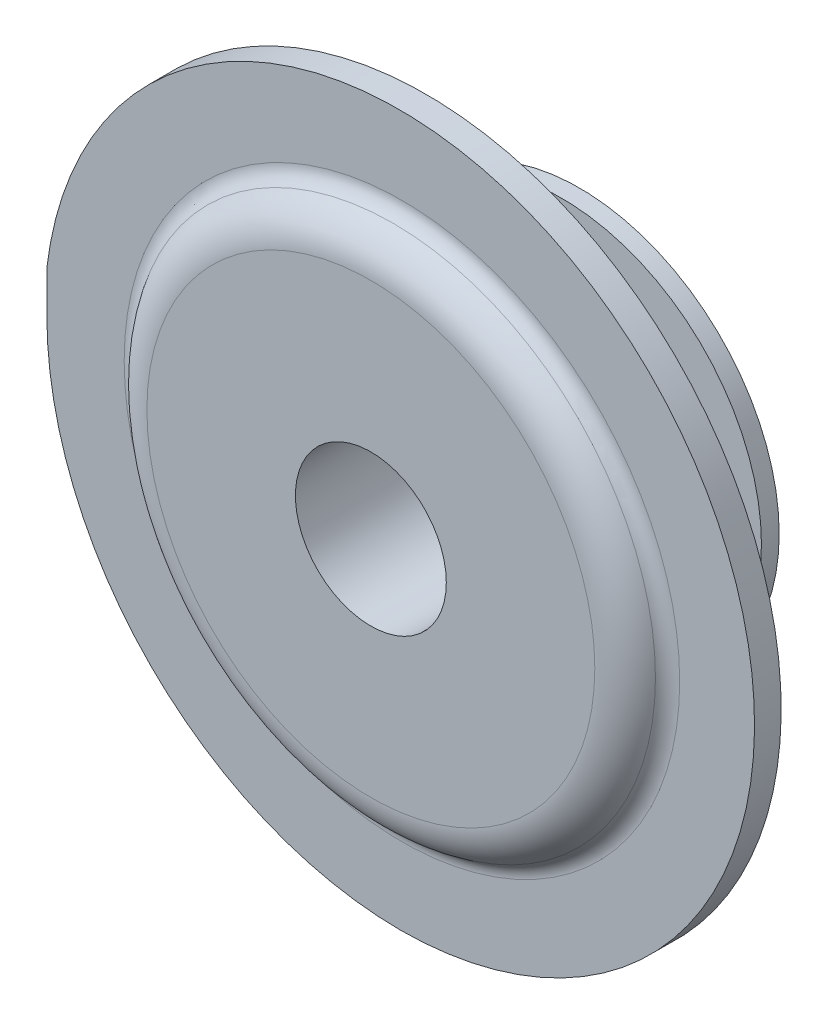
ISO-10303-21;
HEADER;
FILE_DESCRIPTION(('STEP AP214'),'2;1');
FILE_NAME('part.step','',(''),(''),'','','');
FILE_SCHEMA(('AUTOMOTIVE_DESIGN { 1 0 10303 214 1 1 1 1 }'));
ENDSEC;
DATA;
#1=APPLICATION_CONTEXT('core data for automotive mechanical design processes');
#2=APPLICATION_PROTOCOL_DEFINITION('international standard','automotive_design',2000,#1);
#3=PRODUCT_CONTEXT('',#1,'mechanical');
#4=PRODUCT('Part','Part','',(#3));
#5=PRODUCT_RELATED_PRODUCT_CATEGORY('part','',(#4));
#6=PRODUCT_DEFINITION_FORMATION('','',#4);
#7=PRODUCT_DEFINITION_CONTEXT('part definition',#1,'design');
#8=PRODUCT_DEFINITION('design','',#6,#7);
#9=PRODUCT_DEFINITION_SHAPE('','',#8);
#10=(LENGTH_UNIT() NAMED_UNIT(*) SI_UNIT(.MILLI.,.METRE.));
#11=(NAMED_UNIT(*) PLANE_ANGLE_UNIT() SI_UNIT($,.RADIAN.));
#12=(NAMED_UNIT(*) SI_UNIT($,.STERADIAN.) SOLID_ANGLE_UNIT());
#13=UNCERTAINTY_MEASURE_WITH_UNIT(LENGTH_MEASURE(1.E-05),#10,'distance_accuracy_value','');
#14=(GEOMETRIC_REPRESENTATION_CONTEXT(3) GLOBAL_UNCERTAINTY_ASSIGNED_CONTEXT((#13)) GLOBAL_UNIT_ASSIGNED_CONTEXT((#10,
#11,#12)) REPRESENTATION_CONTEXT('',''));
#15=CARTESIAN_POINT('',(0.,0.,0.));
#16=DIRECTION('',(0.,0.,1.));
#17=DIRECTION('',(1.,0.,0.));
#18=AXIS2_PLACEMENT_3D('',#15,#16,#17);
#19=CARTESIAN_POINT('',(0.,0.,0.15));
#20=DIRECTION('',(0.,0.,1.));
#21=DIRECTION('',(1.,0.,0.));
#22=AXIS2_PLACEMENT_3D('',#19,#20,#21);
#23=PLANE('',#22);
#24=CARTESIAN_POINT('',(0.,-12.,0.15));
#25=DIRECTION('',(0.,0.,1.));
#26=DIRECTION('',(1.,0.,0.));
#27=AXIS2_PLACEMENT_3D('',#24,#25,#26);
#28=CIRCLE('',#27,3.12924818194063);
#29=CARTESIAN_POINT('',(3.12924818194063,-12.,0.15));
#30=VERTEX_POINT('',#29);
#31=EDGE_CURVE('E92',#30,#30,#28,.F.);
#32=ORIENTED_EDGE('',*,*,#31,.T.);
#33=EDGE_LOOP('',(#32));
#34=FACE_BOUND('',#33,.T.);
#35=CARTESIAN_POINT('',(0.,-12.,0.15));
#36=DIRECTION('',(0.,0.,1.));
#37=DIRECTION('',(1.,0.,0.));
#38=AXIS2_PLACEMENT_3D('',#35,#36,#37);
#39=CIRCLE('',#38,4.);
#40=CARTESIAN_POINT('',(-4.,-12.,0.15));
#41=VERTEX_POINT('',#40);
#42=CARTESIAN_POINT('',(-0.0138167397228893,-15.9999761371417,0.15));
#43=VERTEX_POINT('',#42);
#44=EDGE_CURVE('E81',#41,#43,#39,.T.);
#45=ORIENTED_EDGE('',*,*,#44,.T.);
#46=CARTESIAN_POINT('',(-0.0276334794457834,-12.,0.150000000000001));
#47=DIRECTION('',(0.,0.,1.));
#48=DIRECTION('',(1.,0.,0.));
#49=AXIS2_PLACEMENT_3D('',#46,#47,#48);
#50=CIRCLE('',#49,4.);
#51=CARTESIAN_POINT('',(-4.,-11.530634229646,0.150000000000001));
#52=VERTEX_POINT('',#51);
#53=EDGE_CURVE('E45',#43,#52,#50,.T.);
#54=ORIENTED_EDGE('',*,*,#53,.T.);
#55=DIRECTION('',(0.,-1.,0.));
#56=VECTOR('',#55,1.);
#57=CARTESIAN_POINT('',(-4.,0.,0.15));
#58=LINE('',#57,#56);
#59=EDGE_CURVE('E52',#52,#41,#58,.T.);
#60=ORIENTED_EDGE('',*,*,#59,.T.);
#61=EDGE_LOOP('',(#45,#54,#60));
#62=FACE_BOUND('',#61,.T.);
#63=ADVANCED_FACE('F31',(#34,#62),#23,.T.);
#64=CARTESIAN_POINT('',(0.,0.,-0.15));
#65=DIRECTION('',(0.,0.,1.));
#66=DIRECTION('',(1.,0.,0.));
#67=AXIS2_PLACEMENT_3D('',#64,#65,#66);
#68=PLANE('',#67);
#69=CARTESIAN_POINT('',(0.,-12.,-0.15));
#70=DIRECTION('',(0.,0.,1.));
#71=DIRECTION('',(1.,0.,0.));
#72=AXIS2_PLACEMENT_3D('',#69,#70,#71);
#73=CIRCLE('',#72,1.);
#74=CARTESIAN_POINT('',(1.,-12.,-0.15));
#75=VERTEX_POINT('',#74);
#76=EDGE_CURVE('E83',#75,#75,#73,.T.);
#77=ORIENTED_EDGE('',*,*,#76,.T.);
#78=EDGE_LOOP('',(#77));
#79=FACE_BOUND('',#78,.T.);
#80=CARTESIAN_POINT('',(-0.0276334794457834,-12.,-0.150000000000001));
#81=DIRECTION('',(0.,0.,1.));
#82=DIRECTION('',(1.,0.,0.));
#83=AXIS2_PLACEMENT_3D('',#80,#81,#82);
#84=CIRCLE('',#83,4.);
#85=CARTESIAN_POINT('',(-0.0138167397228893,-15.9999761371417,-0.15));
#86=VERTEX_POINT('',#85);
#87=CARTESIAN_POINT('',(-4.,-11.530634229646,-0.150000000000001));
#88=VERTEX_POINT('',#87);
#89=EDGE_CURVE('E65',#86,#88,#84,.T.);
#90=ORIENTED_EDGE('',*,*,#89,.F.);
#91=CARTESIAN_POINT('',(0.,-12.,-0.15));
#92=DIRECTION('',(0.,0.,1.));
#93=DIRECTION('',(1.,0.,0.));
#94=AXIS2_PLACEMENT_3D('',#91,#92,#93);
#95=CIRCLE('',#94,4.);
#96=CARTESIAN_POINT('',(-4.,-12.,-0.15));
#97=VERTEX_POINT('',#96);
#98=EDGE_CURVE('E74',#97,#86,#95,.T.);
#99=ORIENTED_EDGE('',*,*,#98,.F.);
#100=DIRECTION('',(0.,-1.,0.));
#101=VECTOR('',#100,1.);
#102=CARTESIAN_POINT('',(-4.,0.,-0.15));
#103=LINE('',#102,#101);
#104=EDGE_CURVE('E75',#88,#97,#103,.T.);
#105=ORIENTED_EDGE('',*,*,#104,.F.);
#106=EDGE_LOOP('',(#90,#99,#105));
#107=FACE_BOUND('',#106,.T.);
#108=ADVANCED_FACE('F73',(#79,#107),#68,.F.);
#109=CARTESIAN_POINT('',(-4.,0.,0.15));
#110=DIRECTION('',(1.,0.,0.));
#111=DIRECTION('',(0.,1.,0.));
#112=AXIS2_PLACEMENT_3D('',#109,#110,#111);
#113=PLANE('',#112);
#114=DIRECTION('',(0.,0.,1.));
#115=VECTOR('',#114,1.);
#116=CARTESIAN_POINT('',(-4.,-11.530634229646,-15.));
#117=LINE('',#116,#115);
#118=EDGE_CURVE('E113',#88,#52,#117,.T.);
#119=ORIENTED_EDGE('',*,*,#118,.F.);
#120=ORIENTED_EDGE('',*,*,#104,.T.);
#121=DIRECTION('',(0.,0.,-1.));
#122=VECTOR('',#121,1.);
#123=CARTESIAN_POINT('',(-4.,-12.,0.15));
#124=LINE('',#123,#122);
#125=EDGE_CURVE('E79',#41,#97,#124,.T.);
#126=ORIENTED_EDGE('',*,*,#125,.F.);
#127=ORIENTED_EDGE('',*,*,#59,.F.);
#128=EDGE_LOOP('',(#119,#120,#126,#127));
#129=FACE_BOUND('',#128,.T.);
#130=ADVANCED_FACE('F33',(#129),#113,.F.);
#131=CARTESIAN_POINT('',(0.,-12.,0.15));
#132=DIRECTION('',(0.,0.,-1.));
#133=DIRECTION('',(-1.,0.,0.));
#134=AXIS2_PLACEMENT_3D('',#131,#132,#133);
#135=CYLINDRICAL_SURFACE('',#134,4.);
#136=DIRECTION('',(0.,0.,1.));
#137=VECTOR('',#136,1.);
#138=CARTESIAN_POINT('',(-0.0138167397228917,-15.9999761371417,0.));
#139=LINE('',#138,#137);
#140=EDGE_CURVE('E12',#43,#86,#139,.F.);
#141=ORIENTED_EDGE('',*,*,#140,.F.);
#142=ORIENTED_EDGE('',*,*,#44,.F.);
#143=ORIENTED_EDGE('',*,*,#125,.T.);
#144=ORIENTED_EDGE('',*,*,#98,.T.);
#145=EDGE_LOOP('',(#141,#142,#143,#144));
#146=FACE_BOUND('',#145,.T.);
#147=ADVANCED_FACE('F78',(#146),#135,.T.);
#148=CARTESIAN_POINT('',(0.,-12.,-1.85));
#149=DIRECTION('',(0.,0.,1.));
#150=DIRECTION('',(1.,0.,0.));
#151=AXIS2_PLACEMENT_3D('',#148,#149,#150);
#152=CYLINDRICAL_SURFACE('',#151,1.);
#153=ORIENTED_EDGE('',*,*,#76,.F.);
#154=EDGE_LOOP('',(#153));
#155=FACE_BOUND('',#154,.T.);
#156=CARTESIAN_POINT('',(0.,-12.,-1.65));
#157=DIRECTION('',(0.,0.,-1.));
#158=DIRECTION('',(-1.,0.,0.));
#159=AXIS2_PLACEMENT_3D('',#156,#157,#158);
#160=CIRCLE('',#159,1.);
#161=CARTESIAN_POINT('',(-1.,-12.,-1.65));
#162=VERTEX_POINT('',#161);
#163=EDGE_CURVE('E99',#162,#162,#160,.F.);
#164=ORIENTED_EDGE('',*,*,#163,.T.);
#165=EDGE_LOOP('',(#164));
#166=FACE_BOUND('',#165,.T.);
#167=ADVANCED_FACE('F133',(#155,#166),#152,.T.);
#168=CARTESIAN_POINT('',(0.,-12.,0.5));
#169=DIRECTION('',(0.,0.,1.));
#170=DIRECTION('',(1.,0.,0.));
#171=AXIS2_PLACEMENT_3D('',#168,#169,#170);
#172=PLANE('',#171);
#173=CARTESIAN_POINT('',(0.,-12.,0.5));
#174=DIRECTION('',(0.,0.,1.));
#175=DIRECTION('',(1.,0.,0.));
#176=AXIS2_PLACEMENT_3D('',#173,#174,#175);
#177=CIRCLE('',#176,0.85);
#178=CARTESIAN_POINT('',(0.85,-12.,0.5));
#179=VERTEX_POINT('',#178);
#180=EDGE_CURVE('E101',#179,#179,#177,.T.);
#181=ORIENTED_EDGE('',*,*,#180,.F.);
#182=EDGE_LOOP('',(#181));
#183=FACE_BOUND('',#182,.T.);
#184=CARTESIAN_POINT('',(0.,-12.,0.5));
#185=DIRECTION('',(0.,0.,1.));
#186=DIRECTION('',(1.,0.,0.));
#187=AXIS2_PLACEMENT_3D('',#184,#185,#186);
#188=CIRCLE('',#187,2.52303039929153);
#189=CARTESIAN_POINT('',(2.52303039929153,-12.,0.5));
#190=VERTEX_POINT('',#189);
#191=EDGE_CURVE('E89',#190,#190,#188,.T.);
#192=ORIENTED_EDGE('',*,*,#191,.T.);
#193=EDGE_LOOP('',(#192));
#194=FACE_BOUND('',#193,.T.);
#195=ADVANCED_FACE('F129',(#183,#194),#172,.T.);
#196=CARTESIAN_POINT('',(0.,-12.,0.));
#197=DIRECTION('',(0.,0.,-1.));
#198=DIRECTION('',(-1.,0.,0.));
#199=AXIS2_PLACEMENT_3D('',#196,#197,#198);
#200=TOROIDAL_SURFACE('',#199,2.52303039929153,0.5);
#201=CARTESIAN_POINT('',(0.,-12.,0.249999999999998));
#202=DIRECTION('',(0.,0.,-1.));
#203=DIRECTION('',(-1.,0.,0.));
#204=AXIS2_PLACEMENT_3D('',#201,#202,#203);
#205=CIRCLE('',#204,2.95604310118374);
#206=CARTESIAN_POINT('',(-2.95604310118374,-12.,0.249999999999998));
#207=VERTEX_POINT('',#206);
#208=EDGE_CURVE('E39',#207,#207,#205,.F.);
#209=ORIENTED_EDGE('',*,*,#208,.T.);
#210=EDGE_LOOP('',(#209));
#211=FACE_BOUND('',#210,.T.);
#212=ORIENTED_EDGE('',*,*,#191,.F.);
#213=EDGE_LOOP('',(#212));
#214=FACE_BOUND('',#213,.T.);
#215=ADVANCED_FACE('F132',(#211,#214),#200,.T.);
#216=CARTESIAN_POINT('',(0.,-12.,0.35));
#217=DIRECTION('',(0.,0.,1.));
#218=DIRECTION('',(1.,0.,0.));
#219=AXIS2_PLACEMENT_3D('',#216,#217,#218);
#220=TOROIDAL_SURFACE('',#219,3.12924818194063,0.2);
#221=ORIENTED_EDGE('',*,*,#208,.F.);
#222=EDGE_LOOP('',(#221));
#223=FACE_BOUND('',#222,.T.);
#224=ORIENTED_EDGE('',*,*,#31,.F.);
#225=EDGE_LOOP('',(#224));
#226=FACE_BOUND('',#225,.T.);
#227=ADVANCED_FACE('F138',(#223,#226),#220,.F.);
#228=CARTESIAN_POINT('',(0.,-12.,-1.85));
#229=DIRECTION('',(0.,0.,1.));
#230=DIRECTION('',(1.,0.,0.));
#231=AXIS2_PLACEMENT_3D('',#228,#229,#230);
#232=PLANE('',#231);
#233=CARTESIAN_POINT('',(0.,-12.,-1.85));
#234=DIRECTION('',(0.,0.,1.));
#235=DIRECTION('',(1.,0.,0.));
#236=AXIS2_PLACEMENT_3D('',#233,#234,#235);
#237=CIRCLE('',#236,0.85);
#238=CARTESIAN_POINT('',(0.85,-12.,-1.85));
#239=VERTEX_POINT('',#238);
#240=EDGE_CURVE('E98',#239,#239,#237,.T.);
#241=ORIENTED_EDGE('',*,*,#240,.T.);
#242=EDGE_LOOP('',(#241));
#243=FACE_BOUND('',#242,.T.);
#244=CARTESIAN_POINT('',(0.,-12.,-1.85));
#245=DIRECTION('',(0.,0.,-1.));
#246=DIRECTION('',(-1.,0.,0.));
#247=AXIS2_PLACEMENT_3D('',#244,#245,#246);
#248=CIRCLE('',#247,2.25);
#249=CARTESIAN_POINT('',(-2.25,-12.,-1.85));
#250=VERTEX_POINT('',#249);
#251=EDGE_CURVE('E108',#250,#250,#248,.T.);
#252=ORIENTED_EDGE('',*,*,#251,.T.);
#253=EDGE_LOOP('',(#252));
#254=FACE_BOUND('',#253,.T.);
#255=ADVANCED_FACE('F119',(#243,#254),#232,.F.);
#256=CARTESIAN_POINT('',(0.,-12.,-1.85));
#257=DIRECTION('',(0.,0.,1.));
#258=DIRECTION('',(1.,0.,0.));
#259=AXIS2_PLACEMENT_3D('',#256,#257,#258);
#260=CYLINDRICAL_SURFACE('',#259,0.85);
#261=ORIENTED_EDGE('',*,*,#240,.F.);
#262=EDGE_LOOP('',(#261));
#263=FACE_BOUND('',#262,.T.);
#264=ORIENTED_EDGE('',*,*,#180,.T.);
#265=EDGE_LOOP('',(#264));
#266=FACE_BOUND('',#265,.T.);
#267=ADVANCED_FACE('F122',(#263,#266),#260,.F.);
#268=CARTESIAN_POINT('',(0.,-12.,-1.65));
#269=DIRECTION('',(0.,0.,-1.));
#270=DIRECTION('',(-1.,0.,0.));
#271=AXIS2_PLACEMENT_3D('',#268,#269,#270);
#272=CYLINDRICAL_SURFACE('',#271,2.25);
#273=CARTESIAN_POINT('',(0.,-12.,-1.65));
#274=DIRECTION('',(0.,0.,-1.));
#275=DIRECTION('',(-1.,0.,0.));
#276=AXIS2_PLACEMENT_3D('',#273,#274,#275);
#277=CIRCLE('',#276,2.25);
#278=CARTESIAN_POINT('',(-2.25,-12.,-1.65));
#279=VERTEX_POINT('',#278);
#280=EDGE_CURVE('E102',#279,#279,#277,.T.);
#281=ORIENTED_EDGE('',*,*,#280,.T.);
#282=EDGE_LOOP('',(#281));
#283=FACE_BOUND('',#282,.T.);
#284=ORIENTED_EDGE('',*,*,#251,.F.);
#285=EDGE_LOOP('',(#284));
#286=FACE_BOUND('',#285,.T.);
#287=ADVANCED_FACE('F125',(#283,#286),#272,.T.);
#288=CARTESIAN_POINT('',(0.,-12.,-1.65));
#289=DIRECTION('',(0.,0.,-1.));
#290=DIRECTION('',(-1.,0.,0.));
#291=AXIS2_PLACEMENT_3D('',#288,#289,#290);
#292=PLANE('',#291);
#293=ORIENTED_EDGE('',*,*,#163,.F.);
#294=EDGE_LOOP('',(#293));
#295=FACE_BOUND('',#294,.T.);
#296=ORIENTED_EDGE('',*,*,#280,.F.);
#297=EDGE_LOOP('',(#296));
#298=FACE_BOUND('',#297,.T.);
#299=ADVANCED_FACE('F179',(#295,#298),#292,.F.);
#300=CARTESIAN_POINT('',(-0.0276334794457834,-12.,-15.));
#301=DIRECTION('',(0.,0.,1.));
#302=DIRECTION('',(1.,0.,0.));
#303=AXIS2_PLACEMENT_3D('',#300,#301,#302);
#304=CYLINDRICAL_SURFACE('',#303,4.);
#305=ORIENTED_EDGE('',*,*,#118,.T.);
#306=ORIENTED_EDGE('',*,*,#53,.F.);
#307=ORIENTED_EDGE('',*,*,#140,.T.);
#308=ORIENTED_EDGE('',*,*,#89,.T.);
#309=EDGE_LOOP('',(#305,#306,#307,#308));
#310=FACE_BOUND('',#309,.T.);
#311=ADVANCED_FACE('F64',(#310),#304,.T.);
#312=CLOSED_SHELL('',(#63,#108,#130,#147,#167,#195,#215,#227,#255,#267,#287,#299,#311));
#313=MANIFOLD_SOLID_BREP('B2',#312);
#314=ADVANCED_BREP_SHAPE_REPRESENTATION('',(#18,#313),#14);
#315=SHAPE_DEFINITION_REPRESENTATION(#9,#314);
ENDSEC;
END-ISO-10303-21;
